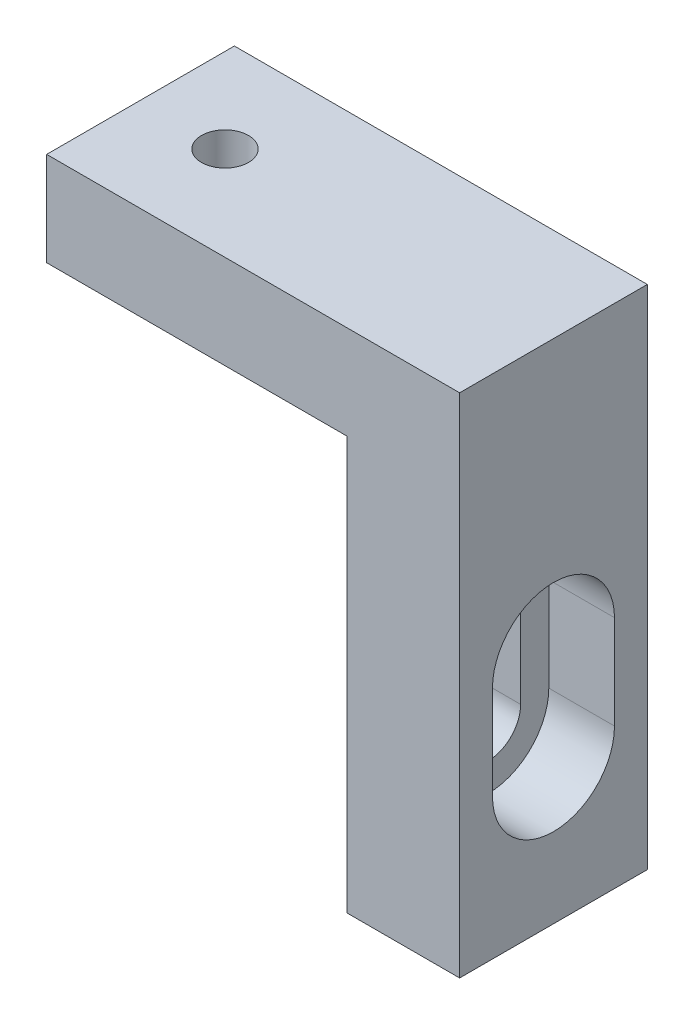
from build123d import *

# Parameters (mm, degrees)
EXTRUDE_1_DEPTH     = 10
CUT_EXTRUDE_1_DEPTH = 10
CUT_EXTRUDE_2_DEPTH = 3.5
SKETCH_4_R          = 1.25
CUT_EXTRUDE_3_DEPTH = 37.235341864


with BuildPart() as part:
    # Sketch 1 → Extrude 1 (new body)
    with BuildSketch(Plane.XY):
        Polygon((16, 0), (16, 22), (0, 22), (0, 27), (22, 27), (22, 0), align=None)
    extrude(amount=EXTRUDE_1_DEPTH)

    # Sketch 2 → Cut-Extrude 1 (cut)
    with BuildSketch(Plane(origin=(22, 0, 0), x_dir=(0, 0, -1), z_dir=(1, 0, 0))):
        with BuildLine():
            Line((-6.75, 7.5), (-6.75, 12.5))
            ThreePointArc((-6.75, 12.5), (-5, 14.25), (-3.25, 12.5))
            Line((-3.25, 12.5), (-3.25, 7.5))
            ThreePointArc((-3.25, 7.5), (-5, 5.75), (-6.75, 7.5))
        make_face()
    extrude(amount=-CUT_EXTRUDE_1_DEPTH, mode=Mode.SUBTRACT)

    # Sketch 3 → Cut-Extrude 2 (cut)
    with BuildSketch(Plane(origin=(22, 0, 0), x_dir=(0, 0, -1), z_dir=(1, 0, 0))):
        with BuildLine():
            Line((-8.25, 7.5), (-8.25, 12.5))
            ThreePointArc((-8.25, 12.5), (-5, 15.75), (-1.75, 12.5))
            Line((-1.75, 12.5), (-1.75, 7.5))
            ThreePointArc((-1.75, 7.5), (-5, 4.25), (-8.25, 7.5))
        make_face()
    extrude(amount=-CUT_EXTRUDE_2_DEPTH, mode=Mode.SUBTRACT)

    # Sketch 4 → Cut-Extrude 3 (cut, through all)
    with BuildSketch(Plane(origin=(0, 27, 0), x_dir=(1, 0, 0), z_dir=(0, 1, 0))):
        with Locations(Location((4.5, -5, 0), (0, 0, 270))):
            Circle(SKETCH_4_R)
    extrude(amount=-CUT_EXTRUDE_3_DEPTH, mode=Mode.SUBTRACT)


solid = part.part
